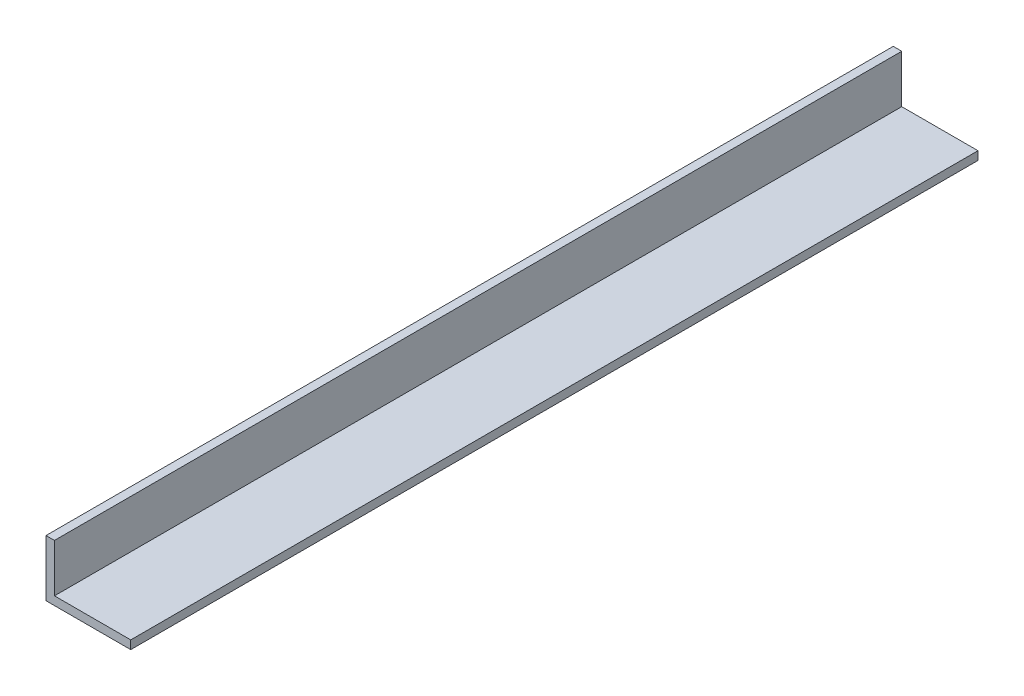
from build123d import *

# Parameters (mm, degrees)
EXTRUDE_1_DEPTH = 150


with BuildPart() as part:
    # Sketch 1 → Extrude 1 (new, symmetric)
    with BuildSketch(Plane.XY):
        Polygon((0, 0), (0, 17), (-3, 17), (-3, -3), (27, -3), (27, 0), align=None)
    extrude(amount=EXTRUDE_1_DEPTH, both=True)


solid = part.part
